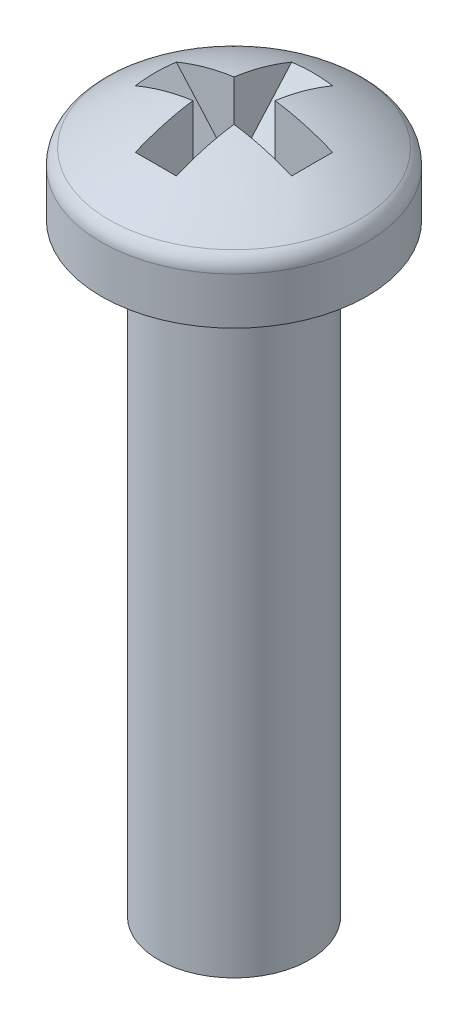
from build123d import *

# Parameters (mm, degrees)
SKETCH2_W          = 1.5875
SKETCH2_H          = 12.7
CUT_EXTRUDE1_DEPTH = 0.4318
CUT_EXTRUDE2_DEPTH = 0.4318


with BuildPart() as part:
    # Sketch1 → Base-Revolve (revolve)
    with BuildSketch(Plane.XY, mode=Mode.PRIVATE) as base_revolve_sk:
        with BuildLine():
            Line((0, 0), (2.794, 0))
            Line((2.794, 0), (2.794, 0.988051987))
            ThreePointArc((2.794, 0.988051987), (2.749892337, 1.170116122), (2.627350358, 1.311806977))
            ThreePointArc((2.627350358, 1.311806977), (1.379087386, 1.963971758), (0, 2.249624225))
            Line((0, 2.249624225), (0, 0))
        make_face()
    revolve(base_revolve_sk.sketch.rotate(Axis((0, 0, 0), (0, 1, 0)), 90), axis=Axis((0, 0, 0), (0, 1, 0)))

    # Sketch2 → Boss-Revolve1 (revolve)
    with BuildSketch(Plane.XY, mode=Mode.PRIVATE) as boss_revolve1_sk:
        with Locations((0.79375, -6.35)):
            Rectangle(SKETCH2_W, SKETCH2_H)
    revolve(boss_revolve1_sk.sketch.rotate(Axis((0, 0, 0), (0, 1, 0)), 90), axis=Axis((0, 0, 0), (0, 1, 0)))

    # Sketch3 → Cut-Extrude1 (cut, symmetric)
    with BuildSketch(Plane.XY):
        Polygon((-2.0193, 3.3909), (2.0193, 3.3909), (2.0193, 2.2606), (0, -0.0254), (-2.0193, 2.2606), align=None)
    extrude(amount=CUT_EXTRUDE1_DEPTH, both=True, mode=Mode.SUBTRACT)

    # Sketch4 → Cut-Extrude2 (cut, symmetric)
    with BuildSketch(Plane(origin=(0, 0, 0), x_dir=(0, 0, -1), z_dir=(1, 0, 0))):
        Polygon((-2.0193, 3.3909), (2.0193, 3.3909), (2.0193, 2.2606), (0, -0.0254), (-2.0193, 2.2606), align=None)
    extrude(amount=CUT_EXTRUDE2_DEPTH, both=True, mode=Mode.SUBTRACT)


solid = part.part
